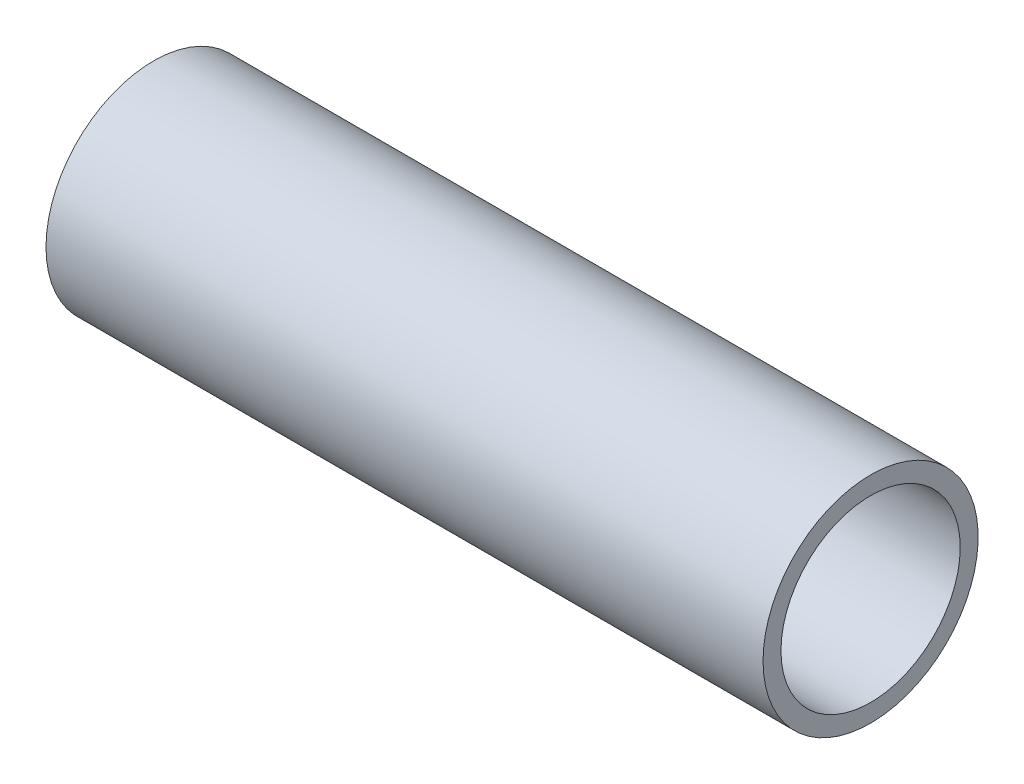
from build123d import *

# Parameters (mm, degrees)
SKIZZE1_W = 200
SKIZZE1_H = 5


with BuildPart() as part:
    # Skizze1 → Rotation1 (revolve)
    with BuildSketch(Plane.XY, mode=Mode.PRIVATE) as rotation1_sk:
        with Locations((100, 27.5)):
            Rectangle(SKIZZE1_W, SKIZZE1_H)
    revolve(rotation1_sk.sketch.rotate(Axis((0, 0, 0), (1, 0, 0)), 90), axis=Axis((0, 0, 0), (1, 0, 0)))


solid = part.part
